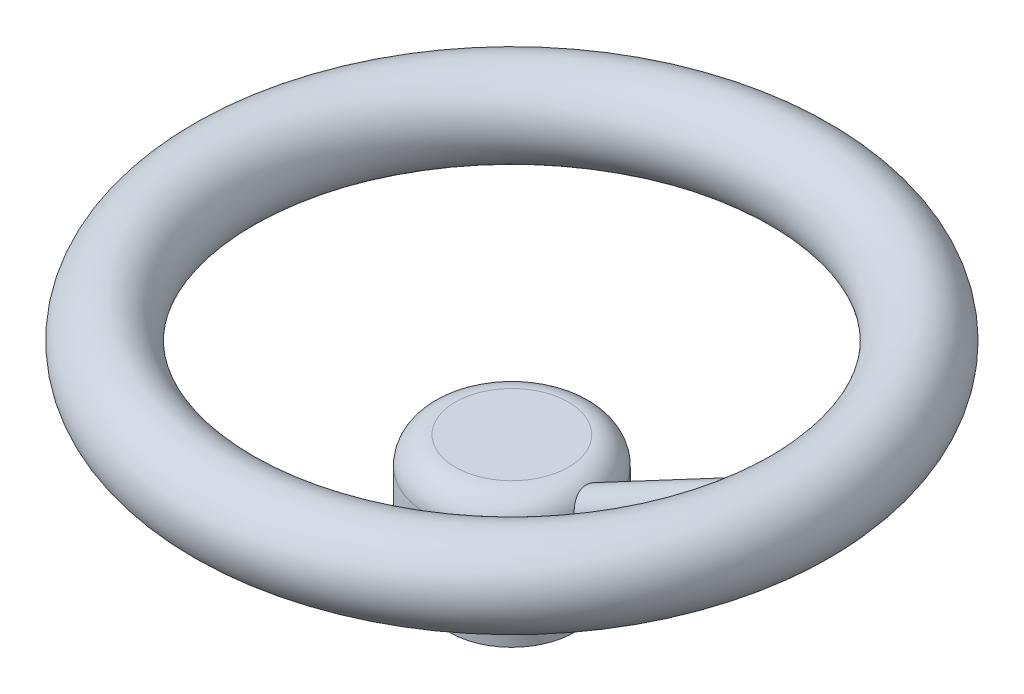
ISO-10303-21;
HEADER;
FILE_DESCRIPTION(('STEP AP214'),'2;1');
FILE_NAME('part.step','',(''),(''),'','','');
FILE_SCHEMA(('AUTOMOTIVE_DESIGN { 1 0 10303 214 1 1 1 1 }'));
ENDSEC;
DATA;
#1=APPLICATION_CONTEXT('core data for automotive mechanical design processes');
#2=APPLICATION_PROTOCOL_DEFINITION('international standard','automotive_design',2000,#1);
#3=PRODUCT_CONTEXT('',#1,'mechanical');
#4=PRODUCT('Part','Part','',(#3));
#5=PRODUCT_RELATED_PRODUCT_CATEGORY('part','',(#4));
#6=PRODUCT_DEFINITION_FORMATION('','',#4);
#7=PRODUCT_DEFINITION_CONTEXT('part definition',#1,'design');
#8=PRODUCT_DEFINITION('design','',#6,#7);
#9=PRODUCT_DEFINITION_SHAPE('','',#8);
#10=(LENGTH_UNIT() NAMED_UNIT(*) SI_UNIT(.MILLI.,.METRE.));
#11=(NAMED_UNIT(*) PLANE_ANGLE_UNIT() SI_UNIT($,.RADIAN.));
#12=(NAMED_UNIT(*) SI_UNIT($,.STERADIAN.) SOLID_ANGLE_UNIT());
#13=UNCERTAINTY_MEASURE_WITH_UNIT(LENGTH_MEASURE(1.E-05),#10,'distance_accuracy_value','');
#14=(GEOMETRIC_REPRESENTATION_CONTEXT(3) GLOBAL_UNCERTAINTY_ASSIGNED_CONTEXT((#13)) GLOBAL_UNIT_ASSIGNED_CONTEXT((#10,
#11,#12)) REPRESENTATION_CONTEXT('',''));
#15=CARTESIAN_POINT('',(0.,0.,0.));
#16=DIRECTION('',(0.,0.,1.));
#17=DIRECTION('',(1.,0.,0.));
#18=AXIS2_PLACEMENT_3D('',#15,#16,#17);
#19=CARTESIAN_POINT('',(0.,-5.72295049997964,0.));
#20=DIRECTION('',(0.,1.,0.));
#21=DIRECTION('',(-1.,0.,0.));
#22=AXIS2_PLACEMENT_3D('',#19,#20,#21);
#23=TOROIDAL_SURFACE('',#22,11.8621252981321,5.72295049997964);
#24=CARTESIAN_POINT('',(0.,0.,0.));
#25=DIRECTION('',(0.,1.,0.));
#26=DIRECTION('',(-1.,0.,0.));
#27=AXIS2_PLACEMENT_3D('',#24,#25,#26);
#28=CIRCLE('',#27,11.8621252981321);
#29=CARTESIAN_POINT('',(-11.8621252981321,0.,0.));
#30=VERTEX_POINT('',#29);
#31=EDGE_CURVE('E44',#30,#30,#28,.T.);
#32=ORIENTED_EDGE('',*,*,#31,.F.);
#33=EDGE_LOOP('',(#32));
#34=FACE_BOUND('',#33,.T.);
#35=CARTESIAN_POINT('',(17.1393614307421,-5.72315049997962,-3.93410478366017));
#36=CARTESIAN_POINT('',(17.1359710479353,-5.61613995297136,-3.94895181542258));
#37=CARTESIAN_POINT('',(17.1302341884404,-5.50870686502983,-3.96039881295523));
#38=CARTESIAN_POINT('',(17.1141599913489,-5.29360425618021,-3.97607408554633));
#39=CARTESIAN_POINT('',(17.1038202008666,-5.18593463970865,-3.98029850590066));
#40=CARTESIAN_POINT('',(17.0786139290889,-4.97089118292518,-3.98109393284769));
#41=CARTESIAN_POINT('',(17.0637393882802,-4.86351821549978,-3.97765124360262));
#42=CARTESIAN_POINT('',(17.0296646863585,-4.6500366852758,-3.96274945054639));
#43=CARTESIAN_POINT('',(17.0104653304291,-4.54392789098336,-3.95129183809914));
#44=CARTESIAN_POINT('',(16.9679336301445,-4.3333635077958,-3.92006129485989));
#45=CARTESIAN_POINT('',(16.9445864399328,-4.22891537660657,-3.90025813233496));
#46=CARTESIAN_POINT('',(16.8941748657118,-4.02289835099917,-3.85220446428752));
#47=CARTESIAN_POINT('',(16.8671106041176,-3.92132936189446,-3.82395423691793));
#48=CARTESIAN_POINT('',(16.8097652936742,-3.72203003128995,-3.75905420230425));
#49=CARTESIAN_POINT('',(16.7794891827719,-3.62429410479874,-3.72241719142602));
#50=CARTESIAN_POINT('',(16.7162266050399,-3.43326616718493,-3.64084973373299));
#51=CARTESIAN_POINT('',(16.6832402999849,-3.33997389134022,-3.59591978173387));
#52=CARTESIAN_POINT('',(16.6170457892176,-3.16352336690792,-3.50071890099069));
#53=CARTESIAN_POINT('',(16.583950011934,-3.08008997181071,-3.45087881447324));
#54=CARTESIAN_POINT('',(16.5164363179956,-2.91827588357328,-3.34430418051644));
#55=CARTESIAN_POINT('',(16.4820179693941,-2.83989686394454,-3.28756736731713));
#56=CARTESIAN_POINT('',(16.4124571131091,-2.68861732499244,-3.16756391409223));
#57=CARTESIAN_POINT('',(16.3773144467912,-2.61571802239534,-3.10429583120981));
#58=CARTESIAN_POINT('',(16.3069305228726,-2.47572646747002,-2.9716648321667));
#59=CARTESIAN_POINT('',(16.2716892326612,-2.40863645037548,-2.90229959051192));
#60=CARTESIAN_POINT('',(16.1658826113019,-2.21485089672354,-2.68389124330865));
#61=CARTESIAN_POINT('',(16.0961033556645,-2.09747825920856,-2.52600072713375));
#62=CARTESIAN_POINT('',(15.9640850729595,-1.88873575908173,-2.19119084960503));
#63=CARTESIAN_POINT('',(15.901847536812,-1.79737103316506,-2.01426773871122));
#64=CARTESIAN_POINT('',(15.7865663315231,-1.63588414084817,-1.63421588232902));
#65=CARTESIAN_POINT('',(15.7343153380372,-1.56739824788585,-1.43014685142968));
#66=CARTESIAN_POINT('',(15.6494379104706,-1.45947722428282,-1.01057247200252));
#67=CARTESIAN_POINT('',(15.6168104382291,-1.42004055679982,-0.795067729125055));
#68=CARTESIAN_POINT('',(15.5746994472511,-1.36957327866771,-0.355721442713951));
#69=CARTESIAN_POINT('',(15.5655124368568,-1.35890649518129,-0.131809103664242));
#70=CARTESIAN_POINT('',(15.5723279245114,-1.36694074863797,0.315100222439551));
#71=CARTESIAN_POINT('',(15.5883298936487,-1.38564116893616,0.53809722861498));
#72=CARTESIAN_POINT('',(15.6429419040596,-1.45189803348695,0.972343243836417));
#73=CARTESIAN_POINT('',(15.6811076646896,-1.49888806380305,1.18373619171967));
#74=CARTESIAN_POINT('',(15.7754981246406,-1.62165857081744,1.5939136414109));
#75=CARTESIAN_POINT('',(15.8317274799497,-1.69744647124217,1.79269487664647));
#76=CARTESIAN_POINT('',(15.9260503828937,-1.83373478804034,2.07938380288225));
#77=CARTESIAN_POINT('',(15.9595840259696,-1.88361593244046,2.17401509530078));
#78=CARTESIAN_POINT('',(16.0290956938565,-1.99089798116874,2.35795322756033));
#79=CARTESIAN_POINT('',(16.0650727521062,-2.04829592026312,2.44726214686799));
#80=CARTESIAN_POINT('',(16.1386693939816,-2.17054649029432,2.61994528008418));
#81=CARTESIAN_POINT('',(16.176289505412,-2.23540152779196,2.7033175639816));
#82=CARTESIAN_POINT('',(16.2523184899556,-2.37234725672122,2.86343999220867));
#83=CARTESIAN_POINT('',(16.2907270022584,-2.44443469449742,2.94019308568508));
#84=CARTESIAN_POINT('',(16.3667777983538,-2.59411260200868,3.08509156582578));
#85=CARTESIAN_POINT('',(16.4044204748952,-2.67156899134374,3.15337518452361));
#86=CARTESIAN_POINT('',(16.4789093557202,-2.8327667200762,3.28248363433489));
#87=CARTESIAN_POINT('',(16.5157558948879,-2.9165053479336,3.34331165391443));
#88=CARTESIAN_POINT('',(16.5879183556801,-3.08974730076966,3.45705776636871));
#89=CARTESIAN_POINT('',(16.6232350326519,-3.17924772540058,3.50997979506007));
#90=CARTESIAN_POINT('',(16.6916696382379,-3.36342827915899,3.60758491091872));
#91=CARTESIAN_POINT('',(16.7247876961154,-3.45810810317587,3.65226848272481));
#92=CARTESIAN_POINT('',(16.786288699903,-3.64608123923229,3.73071040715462));
#93=CARTESIAN_POINT('',(16.8148367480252,-3.73911395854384,3.76496504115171));
#94=CARTESIAN_POINT('',(16.8689953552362,-3.92849593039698,3.82589235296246));
#95=CARTESIAN_POINT('',(16.8946048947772,-4.02484631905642,3.8525624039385));
#96=CARTESIAN_POINT('',(16.9424953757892,-4.22018575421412,3.89831508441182));
#97=CARTESIAN_POINT('',(16.9647749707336,-4.31917584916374,3.91739464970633));
#98=CARTESIAN_POINT('',(17.0056827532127,-4.51905961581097,3.94806524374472));
#99=CARTESIAN_POINT('',(17.0243097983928,-4.61995387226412,3.9596539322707));
#100=CARTESIAN_POINT('',(17.0682148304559,-4.88725531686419,3.98054473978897));
#101=CARTESIAN_POINT('',(17.0902467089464,-5.05473251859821,3.98376351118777));
#102=CARTESIAN_POINT('',(17.1149435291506,-5.30589266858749,3.97497940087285));
#103=CARTESIAN_POINT('',(17.1217810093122,-5.38951112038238,3.96979586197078));
#104=CARTESIAN_POINT('',(17.1326674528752,-5.55654191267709,3.95512442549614));
#105=CARTESIAN_POINT('',(17.1367167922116,-5.63995427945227,3.94563710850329));
#106=CARTESIAN_POINT('',(17.1393614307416,-5.72315049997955,3.93410478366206));
#107=B_SPLINE_CURVE_WITH_KNOTS('',3,(#35,#36,#37,#38,#39,#40,#41,#42,#43,#44,#45,#46,#47,#48,
#49,#50,#51,#52,#53,#54,#55,#56,#57,#58,#59,#60,#61,#62,#63,#64,#65,#66,#67,#68,#69,#70,#71,#72,
#73,#74,#75,#76,#77,#78,#79,#80,#81,#82,#83,#84,#85,#86,#87,#88,#89,#90,#91,#92,#93,#94,#95,#96,
#97,#98,#99,#100,#101,#102,#103,#104,#105,#106),.UNSPECIFIED.,.F.,.F.,(4,2,2,2,2,2,2,2,2,2,2,2,
2,2,2,2,2,2,2,2,2,2,2,2,2,2,2,2,2,2,2,2,2,2,2,4),(0.,0.324224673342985,0.648622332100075,
0.973599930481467,1.29851707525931,1.62462148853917,1.95071516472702,2.27631457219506,
2.60189455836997,2.90953044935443,3.21726768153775,3.52507304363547,3.83299631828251,
4.45627248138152,5.0796716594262,5.74110798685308,6.40250931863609,7.07223643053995,
7.74194947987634,8.3986798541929,9.05557964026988,9.39156408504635,9.72741638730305,
10.063377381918,10.3991879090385,10.7284759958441,11.0576227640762,11.3866051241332,
11.7155681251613,12.0246967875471,12.3339323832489,12.6432926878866,12.9527495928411,
13.4579556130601,13.7100024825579,13.9620153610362),.UNSPECIFIED.);
#108=CARTESIAN_POINT('',(17.1393550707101,-5.72295049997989,-3.93413250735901));
#109=VERTEX_POINT('',#108);
#110=CARTESIAN_POINT('',(17.1393550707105,-5.72295049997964,3.93413250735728));
#111=VERTEX_POINT('',#110);
#112=EDGE_CURVE('E57',#109,#111,#107,.T.);
#113=ORIENTED_EDGE('',*,*,#112,.F.);
#114=CARTESIAN_POINT('',(0.,-5.72295049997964,0.));
#115=DIRECTION('',(0.,1.,0.));
#116=DIRECTION('',(-1.,0.,0.));
#117=AXIS2_PLACEMENT_3D('',#114,#115,#116);
#118=CIRCLE('',#117,17.5850757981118);
#119=EDGE_CURVE('E50',#109,#111,#118,.T.);
#120=ORIENTED_EDGE('',*,*,#119,.T.);
#121=EDGE_LOOP('',(#113,#120));
#122=FACE_BOUND('',#121,.T.);
#123=ADVANCED_FACE('F32',(#34,#122),#23,.T.);
#124=CARTESIAN_POINT('',(0.,0.,0.));
#125=DIRECTION('',(0.,1.,0.));
#126=DIRECTION('',(-1.,0.,0.));
#127=AXIS2_PLACEMENT_3D('',#124,#125,#126);
#128=CYLINDRICAL_SURFACE('',#127,17.5850757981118);
#129=CARTESIAN_POINT('',(0.,-12.382969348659,0.));
#130=DIRECTION('',(0.,1.,0.));
#131=DIRECTION('',(-1.,0.,0.));
#132=AXIS2_PLACEMENT_3D('',#129,#130,#131);
#133=CIRCLE('',#132,17.5850757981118);
#134=CARTESIAN_POINT('',(-17.5850757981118,-12.382969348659,0.));
#135=VERTEX_POINT('',#134);
#136=EDGE_CURVE('E55',#135,#135,#133,.T.);
#137=ORIENTED_EDGE('',*,*,#136,.T.);
#138=EDGE_LOOP('',(#137));
#139=FACE_BOUND('',#138,.T.);
#140=CARTESIAN_POINT('',(17.5850757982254,-9.30662345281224,0.));
#141=CARTESIAN_POINT('',(17.5850754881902,-9.30662293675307,-0.108018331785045));
#142=CARTESIAN_POINT('',(17.5840777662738,-9.30216884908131,-0.21607342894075));
#143=CARTESIAN_POINT('',(17.5801123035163,-9.28437425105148,-0.431460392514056));
#144=CARTESIAN_POINT('',(17.5771433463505,-9.27102825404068,-0.538791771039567));
#145=CARTESIAN_POINT('',(17.5693081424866,-9.23549449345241,-0.752142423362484));
#146=CARTESIAN_POINT('',(17.5644380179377,-9.21328865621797,-0.858158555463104));
#147=CARTESIAN_POINT('',(17.5529329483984,-9.16017052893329,-1.06793067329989));
#148=CARTESIAN_POINT('',(17.5462973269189,-9.12925490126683,-1.17168577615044));
#149=CARTESIAN_POINT('',(17.5314574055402,-9.058982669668,-1.37599675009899));
#150=CARTESIAN_POINT('',(17.5232556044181,-9.01963949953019,-1.47655742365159));
#151=CARTESIAN_POINT('',(17.5054992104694,-8.93273428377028,-1.67398212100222));
#152=CARTESIAN_POINT('',(17.4959441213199,-8.88516922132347,-1.77084477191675));
#153=CARTESIAN_POINT('',(17.4757563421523,-8.7822122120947,-1.96007066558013));
#154=CARTESIAN_POINT('',(17.4651247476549,-8.72682820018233,-2.05243834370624));
#155=CARTESIAN_POINT('',(17.4430620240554,-8.60856703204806,-2.23219228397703));
#156=CARTESIAN_POINT('',(17.4316306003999,-8.54568710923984,-2.3195766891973));
#157=CARTESIAN_POINT('',(17.4082181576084,-8.41254654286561,-2.48921755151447));
#158=CARTESIAN_POINT('',(17.3962345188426,-8.34224811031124,-2.57144398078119));
#159=CARTESIAN_POINT('',(17.3720933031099,-8.19504278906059,-2.7297769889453));
#160=CARTESIAN_POINT('',(17.3599356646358,-8.11813351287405,-2.80588133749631));
#161=CARTESIAN_POINT('',(17.3357737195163,-7.95831571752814,-2.95148903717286));
#162=CARTESIAN_POINT('',(17.3237693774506,-7.8754086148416,-3.0209939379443));
#163=CARTESIAN_POINT('',(17.3002130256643,-7.70415987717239,-3.15309756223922));
#164=CARTESIAN_POINT('',(17.2886611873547,-7.61581621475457,-3.21569368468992));
#165=CARTESIAN_POINT('',(17.2659787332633,-7.43176591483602,-3.33536931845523));
#166=CARTESIAN_POINT('',(17.2548695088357,-7.33592118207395,-3.39224073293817));
#167=CARTESIAN_POINT('',(17.2337026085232,-7.13988851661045,-3.49818426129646));
#168=CARTESIAN_POINT('',(17.2236453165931,-7.03969901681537,-3.54725353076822));
#169=CARTESIAN_POINT('',(17.1954182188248,-6.73372654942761,-3.68253519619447));
#170=CARTESIAN_POINT('',(17.1791757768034,-6.52240213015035,-3.75690995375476));
#171=CARTESIAN_POINT('',(17.1522571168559,-6.07575722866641,-3.87802951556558));
#172=CARTESIAN_POINT('',(17.1420519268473,-5.83979380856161,-3.92246703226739));
#173=CARTESIAN_POINT('',(17.1296466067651,-5.36371553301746,-3.97628242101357));
#174=CARTESIAN_POINT('',(17.1274495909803,-5.12359909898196,-3.98564665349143));
#175=CARTESIAN_POINT('',(17.1310418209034,-4.61779510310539,-3.97019012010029));
#176=CARTESIAN_POINT('',(17.1377469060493,-4.35223514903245,-3.94144962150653));
#177=CARTESIAN_POINT('',(17.1596185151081,-3.82850172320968,-3.84509572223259));
#178=CARTESIAN_POINT('',(17.1747923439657,-3.57033483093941,-3.77744876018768));
#179=CARTESIAN_POINT('',(17.2137113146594,-3.04110792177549,-3.59618484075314));
#180=CARTESIAN_POINT('',(17.2381799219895,-2.77147067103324,-3.47854122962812));
#181=CARTESIAN_POINT('',(17.2921095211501,-2.2562065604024,-3.19968265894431));
#182=CARTESIAN_POINT('',(17.3215681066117,-2.01056821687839,-3.038488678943));
#183=CARTESIAN_POINT('',(17.3755890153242,-1.5989544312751,-2.71027248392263));
#184=CARTESIAN_POINT('',(17.3999513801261,-1.42687428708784,-2.5508725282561));
#185=CARTESIAN_POINT('',(17.4470156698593,-1.11090791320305,-2.20606460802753));
#186=CARTESIAN_POINT('',(17.4697199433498,-0.966981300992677,-2.02069455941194));
#187=CARTESIAN_POINT('',(17.5072645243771,-0.736823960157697,-1.66052081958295));
#188=CARTESIAN_POINT('',(17.522785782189,-0.644916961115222,-1.48945390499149));
#189=CARTESIAN_POINT('',(17.5427112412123,-0.529030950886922,-1.22316790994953));
#190=CARTESIAN_POINT('',(17.5487948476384,-0.494058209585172,-1.13276587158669));
#191=CARTESIAN_POINT('',(17.5596769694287,-0.431961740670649,-0.94924517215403));
#192=CARTESIAN_POINT('',(17.5644760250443,-0.404834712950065,-0.856127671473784));
#193=CARTESIAN_POINT('',(17.5726684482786,-0.35875742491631,-0.667237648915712));
#194=CARTESIAN_POINT('',(17.576053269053,-0.339856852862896,-0.571452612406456));
#195=CARTESIAN_POINT('',(17.5812652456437,-0.310830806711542,-0.378556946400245));
#196=CARTESIAN_POINT('',(17.5830930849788,-0.300701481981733,-0.281446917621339));
#197=CARTESIAN_POINT('',(17.5851317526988,-0.289407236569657,-0.0866903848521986));
#198=CARTESIAN_POINT('',(17.5853426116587,-0.288242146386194,0.0109561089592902));
#199=CARTESIAN_POINT('',(17.5841402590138,-0.294899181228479,0.205926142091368));
#200=CARTESIAN_POINT('',(17.582727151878,-0.302720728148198,0.303249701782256));
#201=CARTESIAN_POINT('',(17.5785251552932,-0.326080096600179,0.487937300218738));
#202=CARTESIAN_POINT('',(17.5758730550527,-0.340851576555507,0.57540223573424));
#203=CARTESIAN_POINT('',(17.5693404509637,-0.377448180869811,0.748807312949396));
#204=CARTESIAN_POINT('',(17.5654595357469,-0.399275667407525,0.834746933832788));
#205=CARTESIAN_POINT('',(17.552118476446,-0.474872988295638,1.08941396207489));
#206=CARTESIAN_POINT('',(17.5409563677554,-0.538777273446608,1.2551387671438));
#207=CARTESIAN_POINT('',(17.5145230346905,-0.693874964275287,1.58264147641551));
#208=CARTESIAN_POINT('',(17.4990794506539,-0.786236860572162,1.74384259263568));
#209=CARTESIAN_POINT('',(17.4657123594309,-0.992776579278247,2.05127229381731));
#210=CARTESIAN_POINT('',(17.4477877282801,-1.10696429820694,2.19749404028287));
#211=CARTESIAN_POINT('',(17.4076067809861,-1.37439383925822,2.49735595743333));
#212=CARTESIAN_POINT('',(17.3851342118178,-1.53097494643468,2.64798118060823));
#213=CARTESIAN_POINT('',(17.3404980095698,-1.8635122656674,2.92606852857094));
#214=CARTESIAN_POINT('',(17.3183345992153,-2.03948170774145,3.05351467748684));
#215=CARTESIAN_POINT('',(17.2716733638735,-2.44379085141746,3.30820663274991));
#216=CARTESIAN_POINT('',(17.2476130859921,-2.67551561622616,3.43017464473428));
#217=CARTESIAN_POINT('',(17.2047634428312,-3.15482095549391,3.6390059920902));
#218=CARTESIAN_POINT('',(17.1859780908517,-3.40241342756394,3.72584262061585));
#219=CARTESIAN_POINT('',(17.1537512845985,-3.94030586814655,3.87169966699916));
#220=CARTESIAN_POINT('',(17.1412969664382,-4.23202529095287,3.9257598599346));
#221=CARTESIAN_POINT('',(17.1277821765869,-4.82099551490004,3.98434621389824));
#222=CARTESIAN_POINT('',(17.1267222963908,-5.11824660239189,3.98886980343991));
#223=CARTESIAN_POINT('',(17.1342502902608,-5.55759337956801,3.95630248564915));
#224=CARTESIAN_POINT('',(17.1381913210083,-5.70146590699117,3.93926773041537));
#225=CARTESIAN_POINT('',(17.1489383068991,-5.98694509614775,3.89222670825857));
#226=CARTESIAN_POINT('',(17.1557427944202,-6.12855288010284,3.86222708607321));
#227=CARTESIAN_POINT('',(17.1720556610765,-6.40808420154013,3.78903532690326));
#228=CARTESIAN_POINT('',(17.1815626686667,-6.54600956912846,3.74584988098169));
#229=CARTESIAN_POINT('',(17.2029869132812,-6.81678305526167,3.64619404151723));
#230=CARTESIAN_POINT('',(17.2149037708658,-6.9496319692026,3.58972573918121));
#231=CARTESIAN_POINT('',(17.2391833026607,-7.19332055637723,3.47111755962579));
#232=CARTESIAN_POINT('',(17.2513248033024,-7.30489990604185,3.41044855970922));
#233=CARTESIAN_POINT('',(17.276769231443,-7.52186947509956,3.27911686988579));
#234=CARTESIAN_POINT('',(17.2900720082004,-7.62726049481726,3.20845547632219));
#235=CARTESIAN_POINT('',(17.3173921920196,-7.83076260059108,3.05756279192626));
#236=CARTESIAN_POINT('',(17.331409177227,-7.92887790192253,2.97733711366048));
#237=CARTESIAN_POINT('',(17.3596769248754,-8.11690529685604,2.80782566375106));
#238=CARTESIAN_POINT('',(17.3739276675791,-8.20681807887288,2.71854065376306));
#239=CARTESIAN_POINT('',(17.4007109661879,-8.36883491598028,2.54113271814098));
#240=CARTESIAN_POINT('',(17.4132707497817,-8.44182011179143,2.45381677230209));
#241=CARTESIAN_POINT('',(17.4377891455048,-8.57984788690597,2.27304132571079));
#242=CARTESIAN_POINT('',(17.4497477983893,-8.64489100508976,2.17958224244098));
#243=CARTESIAN_POINT('',(17.472706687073,-8.76653941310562,1.98715941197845));
#244=CARTESIAN_POINT('',(17.4837065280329,-8.8231412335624,1.88819342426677));
#245=CARTESIAN_POINT('',(17.504405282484,-8.92742787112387,1.68554344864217));
#246=CARTESIAN_POINT('',(17.5141042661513,-8.97511316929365,1.58185971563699));
#247=CARTESIAN_POINT('',(17.531520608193,-9.05934925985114,1.37512543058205));
#248=CARTESIAN_POINT('',(17.5393052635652,-9.09629079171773,1.27223951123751));
#249=CARTESIAN_POINT('',(17.5531910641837,-9.16141902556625,1.06362537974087));
#250=CARTESIAN_POINT('',(17.5592923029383,-9.18960621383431,0.957897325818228));
#251=CARTESIAN_POINT('',(17.5696273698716,-9.23698137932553,0.7446202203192));
#252=CARTESIAN_POINT('',(17.5738655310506,-9.25619024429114,0.637076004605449));
#253=CARTESIAN_POINT('',(17.580374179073,-9.28557057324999,0.420748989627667));
#254=CARTESIAN_POINT('',(17.5826458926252,-9.2957476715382,0.311967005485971));
#255=CARTESIAN_POINT('',(17.5842945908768,-9.30312881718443,0.169176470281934));
#256=CARTESIAN_POINT('',(17.5845874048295,-9.30443908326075,0.13535619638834));
#257=CARTESIAN_POINT('',(17.5849780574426,-9.30618648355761,0.0676918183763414));
#258=CARTESIAN_POINT('',(17.5850758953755,-9.3066236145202,0.0338477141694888));
#259=CARTESIAN_POINT('',(17.5850757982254,-9.30662345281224,0.));
#260=B_SPLINE_CURVE_WITH_KNOTS('',3,(#140,#141,#142,#143,#144,#145,#146,#147,#148,#149,#150,
#151,#152,#153,#154,#155,#156,#157,#158,#159,#160,#161,#162,#163,#164,#165,#166,#167,#168,#169,
#170,#171,#172,#173,#174,#175,#176,#177,#178,#179,#180,#181,#182,#183,#184,#185,#186,#187,#188,
#189,#190,#191,#192,#193,#194,#195,#196,#197,#198,#199,#200,#201,#202,#203,#204,#205,#206,#207,
#208,#209,#210,#211,#212,#213,#214,#215,#216,#217,#218,#219,#220,#221,#222,#223,#224,#225,#226,
#227,#228,#229,#230,#231,#232,#233,#234,#235,#236,#237,#238,#239,#240,#241,#242,#243,#244,#245,
#246,#247,#248,#249,#250,#251,#252,#253,#254,#255,#256,#257,#258,#259),.UNSPECIFIED.,.T.,.F.,(4,
2,2,2,2,2,2,2,2,2,2,2,2,2,2,2,2,2,2,2,2,2,2,2,2,2,2,2,2,2,2,2,2,2,2,2,2,2,2,2,2,2,2,2,2,2,2,2,2,
2,2,2,2,2,2,2,2,2,2,4),(0.,0.324022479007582,0.648245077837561,0.973132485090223,
1.29814455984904,1.62264235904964,1.94725947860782,2.27154950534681,2.59595959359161,
2.92211020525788,3.24837910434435,3.5745712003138,3.90088568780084,4.23650120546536,
4.57223879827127,5.24322625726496,5.96133717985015,6.67972733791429,7.47805334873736,
8.27706904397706,9.15861822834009,10.0397434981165,10.7445327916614,11.4483036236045,
12.0301014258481,12.3211578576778,12.6120916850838,12.9047591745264,13.1972981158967,
13.4898315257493,13.7823461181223,14.0482613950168,14.3142657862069,14.8458282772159,
15.4030528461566,15.9605306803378,16.6134396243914,17.2667968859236,18.0525993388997,
18.8389980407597,19.7256943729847,20.6124367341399,21.0467165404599,21.4807740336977,
21.9146116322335,22.3483809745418,22.7306155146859,23.1128005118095,23.4947623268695,
23.8766920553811,24.2197413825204,24.5627674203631,24.9059340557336,25.2490821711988,
25.5774687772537,25.9058371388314,26.2334377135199,26.5608337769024,26.6623663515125,
26.7638993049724),.UNSPECIFIED.);
#261=EDGE_CURVE('E11',#111,#109,#260,.T.);
#262=ORIENTED_EDGE('',*,*,#261,.F.);
#263=ORIENTED_EDGE('',*,*,#119,.F.);
#264=EDGE_LOOP('',(#262,#263));
#265=FACE_BOUND('',#264,.T.);
#266=ADVANCED_FACE('F52',(#139,#265),#128,.T.);
#267=CARTESIAN_POINT('',(0.,0.,0.));
#268=DIRECTION('',(0.,-1.,0.));
#269=DIRECTION('',(1.,0.,0.));
#270=AXIS2_PLACEMENT_3D('',#267,#268,#269);
#271=PLANE('',#270);
#272=ORIENTED_EDGE('',*,*,#31,.T.);
#273=EDGE_LOOP('',(#272));
#274=FACE_BOUND('',#273,.T.);
#275=ADVANCED_FACE('F34',(#274),#271,.F.);
#276=CARTESIAN_POINT('',(17.5850757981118,-12.382969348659,0.));
#277=DIRECTION('',(0.,1.,0.));
#278=DIRECTION('',(-1.,0.,0.));
#279=AXIS2_PLACEMENT_3D('',#276,#277,#278);
#280=PLANE('',#279);
#281=ORIENTED_EDGE('',*,*,#136,.F.);
#282=EDGE_LOOP('',(#281));
#283=FACE_BOUND('',#282,.T.);
#284=CARTESIAN_POINT('',(0.,-12.382969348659,0.));
#285=DIRECTION('',(0.,1.,0.));
#286=DIRECTION('',(-1.,0.,0.));
#287=AXIS2_PLACEMENT_3D('',#284,#285,#286);
#288=CIRCLE('',#287,13.0620975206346);
#289=CARTESIAN_POINT('',(-13.0620975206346,-12.382969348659,0.));
#290=VERTEX_POINT('',#289);
#291=EDGE_CURVE('E98',#290,#290,#288,.T.);
#292=ORIENTED_EDGE('',*,*,#291,.T.);
#293=EDGE_LOOP('',(#292));
#294=FACE_BOUND('',#293,.T.);
#295=ADVANCED_FACE('F105',(#283,#294),#280,.F.);
#296=CARTESIAN_POINT('',(0.,0.,0.));
#297=DIRECTION('',(0.,1.,0.));
#298=DIRECTION('',(-1.,0.,0.));
#299=AXIS2_PLACEMENT_3D('',#296,#297,#298);
#300=CYLINDRICAL_SURFACE('',#299,13.0620975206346);
#301=ORIENTED_EDGE('',*,*,#291,.F.);
#302=EDGE_LOOP('',(#301));
#303=FACE_BOUND('',#302,.T.);
#304=CARTESIAN_POINT('',(0.,-29.4270498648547,0.));
#305=DIRECTION('',(0.,1.,0.));
#306=DIRECTION('',(-1.,0.,0.));
#307=AXIS2_PLACEMENT_3D('',#304,#305,#306);
#308=CIRCLE('',#307,13.0620975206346);
#309=CARTESIAN_POINT('',(-13.0620975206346,-29.4270498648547,0.));
#310=VERTEX_POINT('',#309);
#311=EDGE_CURVE('E59',#310,#310,#308,.T.);
#312=ORIENTED_EDGE('',*,*,#311,.T.);
#313=EDGE_LOOP('',(#312));
#314=FACE_BOUND('',#313,.T.);
#315=ADVANCED_FACE('F73',(#303,#314),#300,.T.);
#316=CARTESIAN_POINT('',(13.0620975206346,-29.4270498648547,0.));
#317=DIRECTION('',(0.,1.,0.));
#318=DIRECTION('',(-1.,0.,0.));
#319=AXIS2_PLACEMENT_3D('',#316,#317,#318);
#320=PLANE('',#319);
#321=ORIENTED_EDGE('',*,*,#311,.F.);
#322=EDGE_LOOP('',(#321));
#323=FACE_BOUND('',#322,.T.);
#324=ADVANCED_FACE('F65',(#323),#320,.F.);
#325=CARTESIAN_POINT('',(500001.868837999,265841.561187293,0.));
#326=DIRECTION('',(-0.882947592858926,-0.469471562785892,0.));
#327=DIRECTION('',(0.469471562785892,-0.882947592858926,0.));
#328=AXIS2_PLACEMENT_3D('',#325,#326,#327);
#329=CYLINDRICAL_SURFACE('',#328,3.98072672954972);
#330=CARTESIAN_POINT('',(53.1398466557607,12.1095107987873,-3.56885970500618));
#331=CARTESIAN_POINT('',(53.0318041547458,12.2568612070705,-3.65820137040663));
#332=CARTESIAN_POINT('',(52.9248877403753,12.4132516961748,-3.73409272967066));
#333=CARTESIAN_POINT('',(52.7183634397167,12.7416145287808,-3.85649123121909));
#334=CARTESIAN_POINT('',(52.6187536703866,12.9135828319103,-3.90300596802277));
#335=CARTESIAN_POINT('',(52.4311953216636,13.2695061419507,-3.9651574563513));
#336=CARTESIAN_POINT('',(52.3432674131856,13.4534815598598,-3.98074013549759));
#337=CARTESIAN_POINT('',(52.1826745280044,13.8279567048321,-3.98071330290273));
#338=CARTESIAN_POINT('',(52.1100101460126,14.0184566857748,-3.96510257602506));
#339=CARTESIAN_POINT('',(51.9828829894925,14.3965634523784,-3.90466702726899));
#340=CARTESIAN_POINT('',(51.9280927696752,14.5841541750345,-3.860418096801));
#341=CARTESIAN_POINT('',(51.8347081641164,14.9551812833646,-3.74554646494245));
#342=CARTESIAN_POINT('',(51.7961176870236,15.1386166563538,-3.67491740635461));
#343=CARTESIAN_POINT('',(51.7313513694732,15.5110194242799,-3.50344112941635));
#344=CARTESIAN_POINT('',(51.7063766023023,15.6993048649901,-3.40066874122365));
#345=CARTESIAN_POINT('',(51.6708727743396,16.0616820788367,-3.17041613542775));
#346=CARTESIAN_POINT('',(51.6603567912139,16.2357608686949,-3.04291366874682));
#347=CARTESIAN_POINT('',(51.6497265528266,16.5869235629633,-2.74759065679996));
#348=CARTESIAN_POINT('',(51.6511373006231,16.7614720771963,-2.57668626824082));
#349=CARTESIAN_POINT('',(51.6625265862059,17.0806467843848,-2.20913070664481));
#350=CARTESIAN_POINT('',(51.6725015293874,17.2252854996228,-2.01249036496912));
#351=CARTESIAN_POINT('',(51.6930262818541,17.4550350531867,-1.63247063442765));
#352=CARTESIAN_POINT('',(51.7031751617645,17.5461221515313,-1.45272234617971));
#353=CARTESIAN_POINT('',(51.7171283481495,17.6595917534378,-1.17379723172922));
#354=CARTESIAN_POINT('',(51.7215675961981,17.6935540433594,-1.07927500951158));
#355=CARTESIAN_POINT('',(51.7296489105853,17.7531844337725,-0.887633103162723));
#356=CARTESIAN_POINT('',(51.7332913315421,17.7788562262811,-0.790514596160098));
#357=CARTESIAN_POINT('',(51.7394815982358,17.8215378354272,-0.593616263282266));
#358=CARTESIAN_POINT('',(51.7420213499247,17.8384837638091,-0.493822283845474));
#359=CARTESIAN_POINT('',(51.7457365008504,17.8630375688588,-0.293106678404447));
#360=CARTESIAN_POINT('',(51.7469125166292,17.8706496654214,-0.192185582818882));
#361=CARTESIAN_POINT('',(51.7477918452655,17.8763574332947,0.00994451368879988));
#362=CARTESIAN_POINT('',(51.7474950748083,17.8744525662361,0.11115353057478));
#363=CARTESIAN_POINT('',(51.7454614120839,17.8611880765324,0.312903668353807));
#364=CARTESIAN_POINT('',(51.7437246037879,17.8498290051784,0.413444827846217));
#365=CARTESIAN_POINT('',(51.737068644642,17.8052676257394,0.691887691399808));
#366=CARTESIAN_POINT('',(51.7307197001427,17.7619011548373,0.868214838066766));
#367=CARTESIAN_POINT('',(51.7156223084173,17.6485714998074,1.21183183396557));
#368=CARTESIAN_POINT('',(51.706872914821,17.5785978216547,1.37911808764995));
#369=CARTESIAN_POINT('',(51.6886327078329,17.4089061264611,1.71568238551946));
#370=CARTESIAN_POINT('',(51.6791414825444,17.3071800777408,1.88394265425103));
#371=CARTESIAN_POINT('',(51.6633645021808,17.081303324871,2.20480738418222));
#372=CARTESIAN_POINT('',(51.6570806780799,16.9571391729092,2.35740237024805));
#373=CARTESIAN_POINT('',(51.6502270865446,16.6647327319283,2.67302767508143));
#374=CARTESIAN_POINT('',(51.6509765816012,16.4926005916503,2.83249235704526));
#375=CARTESIAN_POINT('',(51.666305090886,16.1272633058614,3.12484583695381));
#376=CARTESIAN_POINT('',(51.6808947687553,15.9340420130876,3.25771404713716));
#377=CARTESIAN_POINT('',(51.7171691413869,15.6252777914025,3.43878236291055));
#378=CARTESIAN_POINT('',(51.7324499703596,15.515147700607,3.49771715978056));
#379=CARTESIAN_POINT('',(51.7687468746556,15.2913339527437,3.60631178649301));
#380=CARTESIAN_POINT('',(51.7897603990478,15.1776518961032,3.65597572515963));
#381=CARTESIAN_POINT('',(51.8379329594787,14.9477956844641,3.74537293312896));
#382=CARTESIAN_POINT('',(51.8650879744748,14.83162320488,3.78511266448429));
#383=CARTESIAN_POINT('',(51.9258068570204,14.5978362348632,3.85406609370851));
#384=CARTESIAN_POINT('',(51.9593696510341,14.4802219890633,3.88328155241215));
#385=CARTESIAN_POINT('',(52.0290665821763,14.257196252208,3.92812072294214));
#386=CARTESIAN_POINT('',(52.0645566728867,14.151805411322,3.94485257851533));
#387=CARTESIAN_POINT('',(52.140564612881,13.9417839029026,3.96911172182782));
#388=CARTESIAN_POINT('',(52.1810818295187,13.8371531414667,3.97664016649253));
#389=CARTESIAN_POINT('',(52.2668256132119,13.6296400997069,3.98227886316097));
#390=CARTESIAN_POINT('',(52.3120498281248,13.526756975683,3.98039379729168));
#391=CARTESIAN_POINT('',(52.4067608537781,13.3236022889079,3.9671395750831));
#392=CARTESIAN_POINT('',(52.4562473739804,13.2233305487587,3.95577106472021));
#393=CARTESIAN_POINT('',(52.5534721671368,13.0366185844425,3.92531071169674));
#394=CARTESIAN_POINT('',(52.6008456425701,12.9498338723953,3.90715839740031));
#395=CARTESIAN_POINT('',(52.6980128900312,12.779532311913,3.86346247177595));
#396=CARTESIAN_POINT('',(52.7478074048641,12.6960164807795,3.83791657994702));
#397=CARTESIAN_POINT('',(52.8999624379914,12.4511261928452,3.75048744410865));
#398=CARTESIAN_POINT('',(53.0051835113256,12.2952399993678,3.67778482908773));
#399=CARTESIAN_POINT('',(53.2204195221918,11.9979909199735,3.50414162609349));
#400=CARTESIAN_POINT('',(53.3304885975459,11.8569950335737,3.40264818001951));
#401=CARTESIAN_POINT('',(53.5482398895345,11.5944918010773,3.17487516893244));
#402=CARTESIAN_POINT('',(53.6559211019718,11.4729925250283,3.04858538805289));
#403=CARTESIAN_POINT('',(53.8731997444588,11.2400359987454,2.76165213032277));
#404=CARTESIAN_POINT('',(53.9820957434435,11.1304697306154,2.59893865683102));
#405=CARTESIAN_POINT('',(54.1846558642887,10.9354682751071,2.25101212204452));
#406=CARTESIAN_POINT('',(54.2783142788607,10.8500421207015,2.06579067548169));
#407=CARTESIAN_POINT('',(54.4472415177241,10.7008945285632,1.66961987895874));
#408=CARTESIAN_POINT('',(54.521696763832,10.6380985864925,1.4579698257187));
#409=CARTESIAN_POINT('',(54.6411253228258,10.5393483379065,1.0205879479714));
#410=CARTESIAN_POINT('',(54.6861196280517,10.5033749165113,0.79486627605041));
#411=CARTESIAN_POINT('',(54.7404210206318,10.4601830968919,0.351717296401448));
#412=CARTESIAN_POINT('',(54.7518846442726,10.4512258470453,0.134723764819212));
#413=CARTESIAN_POINT('',(54.7442349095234,10.4572501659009,-0.298357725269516));
#414=CARTESIAN_POINT('',(54.7251283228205,10.4722264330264,-0.514445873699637));
#415=CARTESIAN_POINT('',(54.659835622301,10.524510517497,-0.928231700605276));
#416=CARTESIAN_POINT('',(54.6150677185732,10.5606507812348,-1.12630678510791));
#417=CARTESIAN_POINT('',(54.5029970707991,10.653921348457,-1.51079645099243));
#418=CARTESIAN_POINT('',(54.4356863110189,10.711059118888,-1.697206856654));
#419=CARTESIAN_POINT('',(54.2788793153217,10.8495837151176,-2.06393873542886));
#420=CARTESIAN_POINT('',(54.1883934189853,10.9320987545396,-2.24340886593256));
#421=CARTESIAN_POINT('',(53.9929599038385,11.1197992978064,-2.5813765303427));
#422=CARTESIAN_POINT('',(53.8880118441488,11.224985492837,-2.73987342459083));
#423=CARTESIAN_POINT('',(53.6765776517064,11.4501975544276,-3.02304122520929));
#424=CARTESIAN_POINT('',(53.570635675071,11.5688129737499,-3.14924184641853));
#425=CARTESIAN_POINT('',(53.3560389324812,11.8251410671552,-3.37768510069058));
#426=CARTESIAN_POINT('',(53.2473849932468,11.9628479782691,-3.47993493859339));
#427=CARTESIAN_POINT('',(53.1398466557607,12.1095107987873,-3.56885970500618));
#428=B_SPLINE_CURVE_WITH_KNOTS('',3,(#330,#331,#332,#333,#334,#335,#336,#337,#338,#339,#340,
#341,#342,#343,#344,#345,#346,#347,#348,#349,#350,#351,#352,#353,#354,#355,#356,#357,#358,#359,
#360,#361,#362,#363,#364,#365,#366,#367,#368,#369,#370,#371,#372,#373,#374,#375,#376,#377,#378,
#379,#380,#381,#382,#383,#384,#385,#386,#387,#388,#389,#390,#391,#392,#393,#394,#395,#396,#397,
#398,#399,#400,#401,#402,#403,#404,#405,#406,#407,#408,#409,#410,#411,#412,#413,#414,#415,#416,
#417,#418,#419,#420,#421,#422,#423,#424,#425,#426,#427),.UNSPECIFIED.,.T.,.F.,(4,2,2,2,2,2,2,2,
2,2,2,2,2,2,2,2,2,2,2,2,2,2,2,2,2,2,2,2,2,2,2,2,2,2,2,2,2,2,2,2,2,2,2,2,2,2,2,2,4),(0.,
0.609523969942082,1.21889029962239,1.82932092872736,2.43977533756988,3.03832014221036,
3.63700927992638,4.2823294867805,4.92823298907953,5.65786088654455,6.3871826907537,
6.98980067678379,7.29108984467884,7.59224465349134,7.89557415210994,8.19876646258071,
8.50197592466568,8.80516770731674,9.34766372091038,9.89037392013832,10.4787696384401,
11.0675191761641,11.7686210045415,12.4702634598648,12.8473418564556,13.22425273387,
13.6009175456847,13.9775193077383,14.3144205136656,14.6512793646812,14.9879706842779,
15.3246390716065,15.6258494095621,15.9271527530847,16.529187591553,17.1436722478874,
17.7584105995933,18.4285342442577,19.0989083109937,19.7942170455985,20.4890297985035,
21.1380508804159,21.7869282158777,22.4029932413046,23.0192775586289,23.6683440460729,
24.3174303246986,24.9242928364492,25.5309725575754),.UNSPECIFIED.);
#429=CARTESIAN_POINT('',(53.1398466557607,12.1095107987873,-3.56885970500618));
#430=VERTEX_POINT('',#429);
#431=EDGE_CURVE('E60',#430,#430,#428,.T.);
#432=ORIENTED_EDGE('',*,*,#431,.F.);
#433=EDGE_LOOP('',(#432));
#434=FACE_BOUND('',#433,.T.);
#435=ORIENTED_EDGE('',*,*,#261,.T.);
#436=ORIENTED_EDGE('',*,*,#112,.T.);
#437=EDGE_LOOP('',(#435,#436));
#438=FACE_BOUND('',#437,.T.);
#439=ADVANCED_FACE('F62',(#434,#438),#329,.T.);
#440=CARTESIAN_POINT('',(0.,17.0750983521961,0.));
#441=DIRECTION('',(0.,1.,0.));
#442=DIRECTION('',(-1.,0.,0.));
#443=AXIS2_PLACEMENT_3D('',#440,#441,#442);
#444=TOROIDAL_SURFACE('',#443,60.4458481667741,8.73498068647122);
#445=ORIENTED_EDGE('',*,*,#431,.T.);
#446=EDGE_LOOP('',(#445));
#447=FACE_BOUND('',#446,.T.);
#448=ADVANCED_FACE('F64',(#447),#444,.T.);
#449=CLOSED_SHELL('',(#123,#266,#275,#295,#315,#324,#439,#448));
#450=MANIFOLD_SOLID_BREP('B2',#449);
#451=ADVANCED_BREP_SHAPE_REPRESENTATION('',(#18,#450),#14);
#452=SHAPE_DEFINITION_REPRESENTATION(#9,#451);
ENDSEC;
END-ISO-10303-21;
